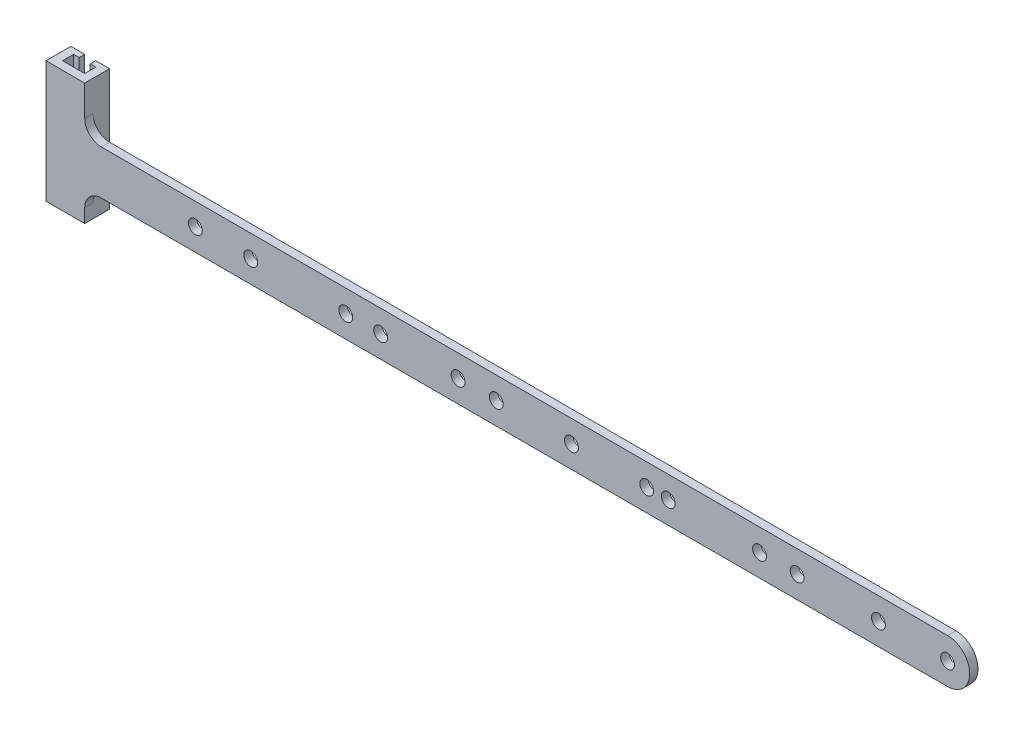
from build123d import *

# Parameters (mm, degrees)
BOSS_EXTRU_1_DEPTH      = 3
ESQUISSE3_W             = 14
ESQUISSE3_H             = 1.5
BOSS_EXTRU_2_DEPTH      = 44
BOSS_EXTRU_3_DEPTH      = 44
ESQUISSE6_R             = 2.5
ENL_V_MAT_EXTRU_1_DEPTH = 309.962976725


with BuildPart() as part:
    # Esquisse1 → Boss.-Extru.1 (new body)
    with BuildSketch(Plane.XY):
        with BuildLine():
            Line((-31.686163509, -19.11469918), (-31.686163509, -63.11469918))
            Line((-31.686163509, -63.11469918), (-17.686163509, -63.11469918))
            Line((-17.686163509, -63.11469918), (-17.686163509, -58.11469918))
            ThreePointArc((-17.686163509, -58.11469918), (-15.928804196, -53.872058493), (-11.686163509, -52.11469918))
            Line((-11.686163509, -52.11469918), (294.313836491, -52.11469918))
            ThreePointArc((294.313836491, -52.11469918), (302.313836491, -44.11469918), (294.313836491, -36.11469918))
            Line((294.313836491, -36.11469918), (-11.686163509, -36.11469918))
            ThreePointArc((-11.686163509, -36.11469918), (-15.928804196, -34.357339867), (-17.686163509, -30.11469918))
            Line((-17.686163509, -30.11469918), (-17.686163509, -19.11469918))
            Line((-17.686163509, -19.11469918), (-31.686163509, -19.11469918))
        make_face()
    extrude(amount=BOSS_EXTRU_1_DEPTH)

    # Esquisse3 → Boss.-Extru.2 (add)
    with BuildSketch(Plane(origin=(0, -19.11469918, 0), x_dir=(1, 0, 0), z_dir=(0, 1, 0))):
        with Locations((-24.686163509, -2.25)):
            Rectangle(ESQUISSE3_W, ESQUISSE3_H)
    extrude(amount=-BOSS_EXTRU_2_DEPTH)

    # Esquisse5 → Boss.-Extru.3 (add)
    with BuildSketch(Plane(origin=(0, -19.11469918, 0), x_dir=(1, 0, 0), z_dir=(0, 1, 0))):
        Polygon((-31.686163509, 0), (-28.686163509, 0), (-28.686163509, 4), (-26.686163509, 4), (-26.686163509, 6), (-31.686163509, 6), align=None)
        Polygon((-17.686163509, 0), (-20.686163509, 0), (-20.686163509, 4), (-22.686163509, 4), (-22.686163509, 6), (-17.686163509, 6), align=None)
    extrude(amount=-BOSS_EXTRU_3_DEPTH)

    # Esquisse6 → Enl_v. mat.-Extru.1 (cut, through all)
    with BuildSketch(Plane.XY.offset(3)):
        with Locations((294.313836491, -44.11469918)):
            Circle(ESQUISSE6_R)
        with Locations((22.313836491, -44.11469918)):
            Circle(ESQUISSE6_R)
        with Locations((42.313836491, -44.11469918)):
            Circle(ESQUISSE6_R)
        with Locations((76.713836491, -44.11469918)):
            Circle(ESQUISSE6_R)
        with Locations((131.113836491, -44.11469918)):
            Circle(ESQUISSE6_R)
        with Locations((193.313836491, -44.11469918)):
            Circle(ESQUISSE6_R)
        with Locations((226.313836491, -44.11469918)):
            Circle(ESQUISSE6_R)
        with Locations((239.913836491, -44.11469918)):
            Circle(ESQUISSE6_R)
        with Locations((117.313836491, -44.11469918)):
            Circle(ESQUISSE6_R)
        with Locations((158.313836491, -44.11469918)):
            Circle(ESQUISSE6_R)
        with Locations((89.313836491, -44.11469918)):
            Circle(ESQUISSE6_R)
        with Locations((185.513836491, -44.11469918)):
            Circle(ESQUISSE6_R)
        with Locations((269.313836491, -44.11469918)):
            Circle(ESQUISSE6_R)
    extrude(amount=-ENL_V_MAT_EXTRU_1_DEPTH, mode=Mode.SUBTRACT)


solid = part.part
